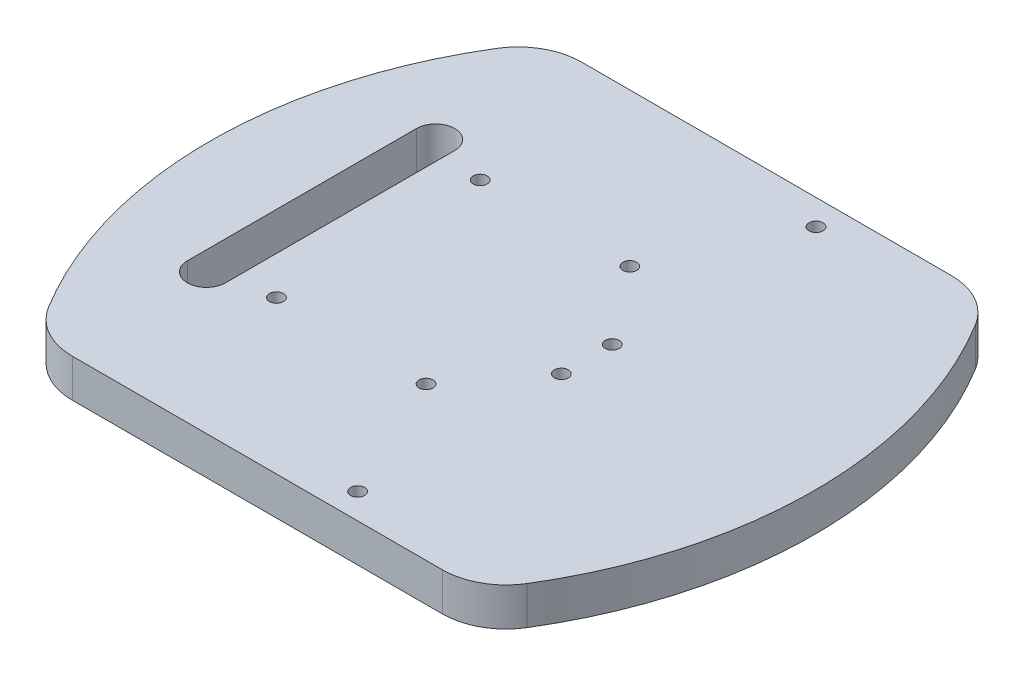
from build123d import *

# Parameters (mm, degrees)
ESQUISSE1_R      = 1.1
EXTRUSION1_DEPTH = 6


with BuildPart() as part:
    # Esquisse1 → Extrusion1 (new body)
    with BuildSketch(Plane(origin=(0, 0, 0), x_dir=(1, 0, 0), z_dir=(0, 1, 0))):
        with BuildLine():
            Line((-34.053542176, 40), (24.053542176, 40))
            ThreePointArc((24.053542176, 40), (28.943638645, 38.72278376), (32.584592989, 35.217391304))
            ThreePointArc((32.584592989, 35.217391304), (42.5, 0), (32.584592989, -35.217391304))
            ThreePointArc((32.584592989, -35.217391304), (28.943638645, -38.72278376), (24.053542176, -40))
            Line((24.053542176, -40), (-34.053542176, -40))
            ThreePointArc((-34.053542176, -40), (-38.943638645, -38.72278376), (-42.584592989, -35.217391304))
            ThreePointArc((-42.584592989, -35.217391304), (-52.5, 0), (-42.584592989, 35.217391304))
            ThreePointArc((-42.584592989, 35.217391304), (-38.943638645, 38.72278376), (-34.053542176, 40))
        make_face()
        with Locations(Location((-2.5, 16, 0), (0, 0, 270))):
            Circle(ESQUISSE1_R, mode=Mode.SUBTRACT)
        with Locations(Location((-26, 16, 0), (0, 0, 270))):
            Circle(ESQUISSE1_R, mode=Mode.SUBTRACT)
        with Locations(Location((-2.5, -16, 0), (0, 0, 90))):
            Circle(ESQUISSE1_R, mode=Mode.SUBTRACT)
        with Locations(Location((-26, -16, 0), (0, 0, 90))):
            Circle(ESQUISSE1_R, mode=Mode.SUBTRACT)
        with Locations(Location((6.75, 36, 0), (0, 0, 270))):
            Circle(ESQUISSE1_R, mode=Mode.SUBTRACT)
        with Locations(Location((6.75, 4, 0), (0, 0, 90))):
            Circle(ESQUISSE1_R, mode=Mode.SUBTRACT)
        with Locations(Location((6.75, -36, 0), (0, 0, 90))):
            Circle(ESQUISSE1_R, mode=Mode.SUBTRACT)
        with Locations(Location((6.75, -4, 0), (0, 0, 270))):
            Circle(ESQUISSE1_R, mode=Mode.SUBTRACT)
        with BuildLine():
            Line((-38, 18), (-38, -18))
            ThreePointArc((-38, -18), (-35, -21), (-32, -18))
            Line((-32, -18), (-32, 18))
            ThreePointArc((-32, 18), (-35, 21), (-38, 18))
        make_face(mode=Mode.SUBTRACT)
    extrude(amount=EXTRUSION1_DEPTH)


solid = part.part
